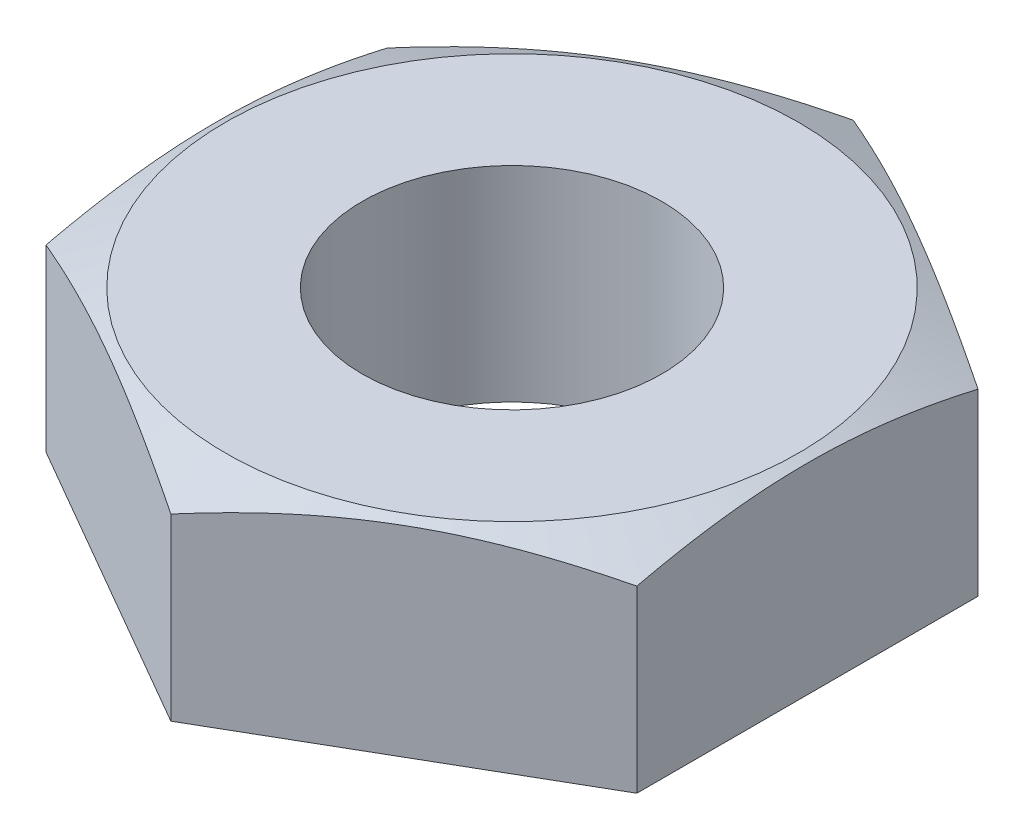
ISO-10303-21;
HEADER;
FILE_DESCRIPTION(('STEP AP214'),'2;1');
FILE_NAME('part.step','',(''),(''),'','','');
FILE_SCHEMA(('AUTOMOTIVE_DESIGN { 1 0 10303 214 1 1 1 1 }'));
ENDSEC;
DATA;
#1=APPLICATION_CONTEXT('core data for automotive mechanical design processes');
#2=APPLICATION_PROTOCOL_DEFINITION('international standard','automotive_design',2000,#1);
#3=PRODUCT_CONTEXT('',#1,'mechanical');
#4=PRODUCT('Part','Part','',(#3));
#5=PRODUCT_RELATED_PRODUCT_CATEGORY('part','',(#4));
#6=PRODUCT_DEFINITION_FORMATION('','',#4);
#7=PRODUCT_DEFINITION_CONTEXT('part definition',#1,'design');
#8=PRODUCT_DEFINITION('design','',#6,#7);
#9=PRODUCT_DEFINITION_SHAPE('','',#8);
#10=(LENGTH_UNIT() NAMED_UNIT(*) SI_UNIT(.MILLI.,.METRE.));
#11=(NAMED_UNIT(*) PLANE_ANGLE_UNIT() SI_UNIT($,.RADIAN.));
#12=(NAMED_UNIT(*) SI_UNIT($,.STERADIAN.) SOLID_ANGLE_UNIT());
#13=UNCERTAINTY_MEASURE_WITH_UNIT(LENGTH_MEASURE(1.E-05),#10,'distance_accuracy_value','');
#14=(GEOMETRIC_REPRESENTATION_CONTEXT(3) GLOBAL_UNCERTAINTY_ASSIGNED_CONTEXT((#13)) GLOBAL_UNIT_ASSIGNED_CONTEXT((#10,
#11,#12)) REPRESENTATION_CONTEXT('',''));
#15=CARTESIAN_POINT('',(0.,0.,0.));
#16=DIRECTION('',(0.,0.,1.));
#17=DIRECTION('',(1.,0.,0.));
#18=AXIS2_PLACEMENT_3D('',#15,#16,#17);
#19=CARTESIAN_POINT('',(-1.66533453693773E-13,-33.0200000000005,9.99200722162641E-13));
#20=DIRECTION('',(0.,-1.,0.));
#21=DIRECTION('',(0.,0.,-1.00000000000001));
#22=AXIS2_PLACEMENT_3D('',#19,#20,#21);
#23=CYLINDRICAL_SURFACE('',#22,2.413);
#24=CARTESIAN_POINT('',(-6.38378239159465E-13,-5.96744875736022E-13,1.11022302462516E-13));
#25=DIRECTION('',(0.,-1.,0.));
#26=DIRECTION('',(0.,0.,-1.00000000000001));
#27=AXIS2_PLACEMENT_3D('',#24,#25,#26);
#28=CIRCLE('',#27,2.413);
#29=CARTESIAN_POINT('',(-6.46147246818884E-13,-5.96744890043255E-13,-2.41299999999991));
#30=VERTEX_POINT('',#29);
#31=EDGE_CURVE('E11',#30,#30,#28,.T.);
#32=ORIENTED_EDGE('',*,*,#31,.T.);
#33=EDGE_LOOP('',(#32));
#34=FACE_BOUND('',#33,.T.);
#35=CARTESIAN_POINT('',(-1.11022302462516E-13,3.30199999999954,-4.44089209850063E-13));
#36=DIRECTION('',(0.,-1.,0.));
#37=DIRECTION('',(0.,0.,-1.00000000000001));
#38=AXIS2_PLACEMENT_3D('',#35,#36,#37);
#39=CIRCLE('',#38,2.413);
#40=CARTESIAN_POINT('',(-1.18791310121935E-13,3.30199999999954,-2.41300000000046));
#41=VERTEX_POINT('',#40);
#42=EDGE_CURVE('E38',#41,#41,#39,.T.);
#43=ORIENTED_EDGE('',*,*,#42,.F.);
#44=EDGE_LOOP('',(#43));
#45=FACE_BOUND('',#44,.T.);
#46=ADVANCED_FACE('F31',(#34,#45),#23,.F.);
#47=CARTESIAN_POINT('',(2.41299999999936,3.30199999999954,-6.66133814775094E-13));
#48=DIRECTION('',(0.,1.,0.));
#49=DIRECTION('',(0.,0.,1.00000000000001));
#50=AXIS2_PLACEMENT_3D('',#47,#48,#49);
#51=PLANE('',#50);
#52=ORIENTED_EDGE('',*,*,#42,.T.);
#53=EDGE_LOOP('',(#52));
#54=FACE_BOUND('',#53,.T.);
#55=CARTESIAN_POINT('',(-1.11022302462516E-13,3.30199999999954,-4.44089209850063E-13));
#56=DIRECTION('',(0.,-1.,0.));
#57=DIRECTION('',(0.,0.,-1.00000000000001));
#58=AXIS2_PLACEMENT_3D('',#55,#56,#57);
#59=CIRCLE('',#58,4.6193795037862);
#60=CARTESIAN_POINT('',(-1.25895072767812E-13,3.30199999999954,-4.61937950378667));
#61=VERTEX_POINT('',#60);
#62=EDGE_CURVE('E196',#61,#61,#59,.T.);
#63=ORIENTED_EDGE('',*,*,#62,.F.);
#64=EDGE_LOOP('',(#63));
#65=FACE_BOUND('',#64,.T.);
#66=ADVANCED_FACE('F184',(#54,#65),#51,.T.);
#67=CARTESIAN_POINT('',(-8.32667268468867E-13,2.89170437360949,-6.10622663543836E-13));
#68=DIRECTION('',(0.,-1.,0.));
#69=DIRECTION('',(0.,0.,-1.00000000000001));
#70=AXIS2_PLACEMENT_3D('',#67,#68,#69);
#71=CONICAL_SURFACE('',#70,5.49926131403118,1.1344640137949);
#72=CARTESIAN_POINT('',(4.76249999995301,1.39901202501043,-7.28111877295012));
#73=CARTESIAN_POINT('',(4.76249999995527,1.48248377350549,-7.06715898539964));
#74=CARTESIAN_POINT('',(4.76249999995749,1.56504133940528,-6.85283581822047));
#75=CARTESIAN_POINT('',(4.76249999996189,1.72780949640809,-6.42326997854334));
#76=CARTESIAN_POINT('',(4.76249999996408,1.80801978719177,-6.20802719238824));
#77=CARTESIAN_POINT('',(4.76249999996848,1.9658210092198,-5.77575029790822));
#78=CARTESIAN_POINT('',(4.7624999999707,2.04340210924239,-5.55871258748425));
#79=CARTESIAN_POINT('',(4.76249999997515,2.19491950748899,-5.12337226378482));
#80=CARTESIAN_POINT('',(4.76249999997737,2.26885593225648,-4.90506969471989));
#81=CARTESIAN_POINT('',(4.76249999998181,2.41118332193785,-4.46988361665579));
#82=CARTESIAN_POINT('',(4.76249999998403,2.47963519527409,-4.25302013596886));
#83=CARTESIAN_POINT('',(4.76249999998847,2.61090094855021,-3.81757071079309));
#84=CARTESIAN_POINT('',(4.7624999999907,2.67371453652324,-3.59898467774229));
#85=CARTESIAN_POINT('',(4.76249999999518,2.79215170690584,-3.16008124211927));
#86=CARTESIAN_POINT('',(4.76249999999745,2.84778233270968,-2.93976576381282));
#87=CARTESIAN_POINT('',(4.76250000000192,2.95011277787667,-2.49709707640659));
#88=CARTESIAN_POINT('',(4.76250000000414,2.99681384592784,-2.27474415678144));
#89=CARTESIAN_POINT('',(4.76250000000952,3.09428518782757,-1.74621511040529));
#90=CARTESIAN_POINT('',(4.76250000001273,3.14030092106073,-1.43911371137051));
#91=CARTESIAN_POINT('',(4.76250000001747,3.19014406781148,-0.976499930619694));
#92=CARTESIAN_POINT('',(4.76250000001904,3.20356111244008,-0.821992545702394));
#93=CARTESIAN_POINT('',(4.76250000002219,3.22358033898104,-0.512526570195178));
#94=CARTESIAN_POINT('',(4.76250000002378,3.23018257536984,-0.357567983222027));
#95=CARTESIAN_POINT('',(4.76250000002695,3.23633945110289,-0.0468466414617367));
#96=CARTESIAN_POINT('',(4.76250000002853,3.23586378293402,0.108916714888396));
#97=CARTESIAN_POINT('',(4.76250000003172,3.22781059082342,0.42025958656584));
#98=CARTESIAN_POINT('',(4.76250000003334,3.2202329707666,0.57583909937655));
#99=CARTESIAN_POINT('',(4.76250000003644,3.19824799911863,0.886538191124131));
#100=CARTESIAN_POINT('',(4.76250000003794,3.18383946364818,1.04165768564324));
#101=CARTESIAN_POINT('',(4.76250000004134,3.14867739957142,1.35115677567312));
#102=CARTESIAN_POINT('',(4.76250000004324,3.12792406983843,1.50553639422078));
#103=CARTESIAN_POINT('',(4.76250000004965,3.04027443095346,2.07678956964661));
#104=CARTESIAN_POINT('',(4.76250000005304,2.95517532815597,2.4909257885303));
#105=CARTESIAN_POINT('',(4.76250000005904,2.80579231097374,3.10669744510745));
#106=CARTESIAN_POINT('',(4.76250000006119,2.75233403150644,3.3111794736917));
#107=CARTESIAN_POINT('',(4.7625000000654,2.63953896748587,3.71852412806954));
#108=CARTESIAN_POINT('',(4.76250000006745,2.5802025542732,3.92138685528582));
#109=CARTESIAN_POINT('',(4.76250000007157,2.45646587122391,4.32677467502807));
#110=CARTESIAN_POINT('',(4.76250000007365,2.39203933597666,4.52929165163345));
#111=CARTESIAN_POINT('',(4.76250000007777,2.25934369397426,4.93306201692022));
#112=CARTESIAN_POINT('',(4.76250000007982,2.19107454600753,5.13431539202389));
#113=CARTESIAN_POINT('',(4.76250000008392,2.05146838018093,5.53563759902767));
#114=CARTESIAN_POINT('',(4.76250000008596,1.98013292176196,5.73570697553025));
#115=CARTESIAN_POINT('',(4.76250000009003,1.834934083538,6.13492790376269));
#116=CARTESIAN_POINT('',(4.76250000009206,1.76107065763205,6.33407943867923));
#117=CARTESIAN_POINT('',(4.76250000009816,1.53585582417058,6.93180306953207));
#118=CARTESIAN_POINT('',(4.76250000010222,1.38138978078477,7.32920086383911));
#119=CARTESIAN_POINT('',(4.76250000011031,1.06676810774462,8.12178148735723));
#120=CARTESIAN_POINT('',(4.76250000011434,0.906611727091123,8.51696401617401));
#121=CARTESIAN_POINT('',(4.76250000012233,0.584326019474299,9.30061588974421));
#122=CARTESIAN_POINT('',(4.7625000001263,0.422248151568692,9.68910643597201));
#123=CARTESIAN_POINT('',(4.76250000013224,0.176972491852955,10.2708789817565));
#124=CARTESIAN_POINT('',(4.76250000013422,0.0948632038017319,10.4646215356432));
#125=CARTESIAN_POINT('',(4.76250000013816,-0.0699891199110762,10.8518355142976));
#126=CARTESIAN_POINT('',(4.76250000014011,-0.152732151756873,11.0453069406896));
#127=CARTESIAN_POINT('',(4.76250000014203,-0.23574680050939,11.2386618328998));
#128=B_SPLINE_CURVE_WITH_KNOTS('',3,(#72,#73,#74,#75,#76,#77,#78,#79,#80,#81,#82,#83,#84,#85,
#86,#87,#88,#89,#90,#91,#92,#93,#94,#95,#96,#97,#98,#99,#100,#101,#102,#103,#104,#105,#106,#107,
#108,#109,#110,#111,#112,#113,#114,#115,#116,#117,#118,#119,#120,#121,#122,#123,#124,#125,#126,
#127),.UNSPECIFIED.,.F.,.F.,(4,2,2,2,2,2,2,2,2,2,2,2,2,2,2,2,2,2,2,2,2,2,2,2,2,2,2,4),(0.,
0.689004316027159,1.37809640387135,2.06953100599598,2.76094158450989,3.44311143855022,
4.12531659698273,4.80684764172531,5.48828331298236,6.41885233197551,6.88399234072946,
7.34912863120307,7.81625720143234,8.2833920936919,8.75060797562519,9.21780921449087,
10.4842421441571,11.1182778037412,11.7522734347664,12.3897861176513,13.02730563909,
13.6645046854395,14.3017153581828,15.580727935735,16.8599099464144,18.1227257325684,
18.7539959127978,19.3852622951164),.UNSPECIFIED.);
#129=CARTESIAN_POINT('',(4.76249999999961,2.8917043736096,-2.74963065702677));
#130=VERTEX_POINT('',#129);
#131=CARTESIAN_POINT('',(4.76250000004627,2.89170437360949,2.74963065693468));
#132=VERTEX_POINT('',#131);
#133=EDGE_CURVE('E170',#130,#132,#128,.T.);
#134=ORIENTED_EDGE('',*,*,#133,.F.);
#135=CARTESIAN_POINT('',(-0.000200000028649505,2.89165052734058,-5.4993767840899));
#136=CARTESIAN_POINT('',(0.143828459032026,2.93042689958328,-5.41622191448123));
#137=CARTESIAN_POINT('',(0.288388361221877,2.96671319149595,-5.33276021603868));
#138=CARTESIAN_POINT('',(0.578592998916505,3.03344126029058,-5.16521049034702));
#139=CARTESIAN_POINT('',(0.724238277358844,3.06387987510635,-5.08112214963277));
#140=CARTESIAN_POINT('',(1.0166170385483,3.11802986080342,-4.91231719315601));
#141=CARTESIAN_POINT('',(1.16335141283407,3.14173490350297,-4.82760006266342));
#142=CARTESIAN_POINT('',(1.4575724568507,3.18154271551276,-4.65773146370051));
#143=CARTESIAN_POINT('',(1.60505898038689,3.19764690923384,-4.57258007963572));
#144=CARTESIAN_POINT('',(1.89747592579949,3.22136340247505,-4.40375307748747));
#145=CARTESIAN_POINT('',(2.04239593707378,3.22914485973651,-4.32008346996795));
#146=CARTESIAN_POINT('',(2.33240313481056,3.2364756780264,-4.15264773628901));
#147=CARTESIAN_POINT('',(2.47749033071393,3.23602454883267,-4.0688816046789));
#148=CARTESIAN_POINT('',(2.76733261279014,3.22691293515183,-3.90154108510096));
#149=CARTESIAN_POINT('',(2.91208788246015,3.21826010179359,-3.817966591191));
#150=CARTESIAN_POINT('',(3.20106949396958,3.19311762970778,-3.65112297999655));
#151=CARTESIAN_POINT('',(3.34529588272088,3.17662870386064,-3.56785383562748));
#152=CARTESIAN_POINT('',(3.59582570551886,3.14163618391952,-3.42321037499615));
#153=CARTESIAN_POINT('',(3.70230276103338,3.12475288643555,-3.36173581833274));
#154=CARTESIAN_POINT('',(3.9147700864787,3.08733994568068,-3.2390677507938));
#155=CARTESIAN_POINT('',(4.02076037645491,3.06681045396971,-3.17787422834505));
#156=CARTESIAN_POINT('',(4.23307314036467,3.02226176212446,-3.05529539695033));
#157=CARTESIAN_POINT('',(4.3393913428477,2.9982156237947,-2.99391255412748));
#158=CARTESIAN_POINT('',(4.55146553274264,2.94710845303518,-2.87147146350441));
#159=CARTESIAN_POINT('',(4.65722161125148,2.92004792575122,-2.81041316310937));
#160=CARTESIAN_POINT('',(4.7626999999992,2.89165052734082,-2.74951518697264));
#161=B_SPLINE_CURVE_WITH_KNOTS('',3,(#135,#136,#137,#138,#139,#140,#141,#142,#143,#144,#145,
#146,#147,#148,#149,#150,#151,#152,#153,#154,#155,#156,#157,#158,#159,#160),.UNSPECIFIED.,.F.,
.F.,(4,2,2,2,2,2,2,2,2,2,2,2,4),(0.,0.512340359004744,1.02495698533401,1.53805378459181,
2.05105439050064,2.55341778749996,3.05581109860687,3.55773620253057,4.05961565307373,
4.43186988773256,4.80410865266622,5.1793647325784,5.55455802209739),.UNSPECIFIED.);
#162=CARTESIAN_POINT('',(-2.89213097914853E-11,2.89170437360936,-5.49926131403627));
#163=VERTEX_POINT('',#162);
#164=EDGE_CURVE('E92',#163,#130,#161,.T.);
#165=ORIENTED_EDGE('',*,*,#164,.F.);
#166=CARTESIAN_POINT('',(-4.76270000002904,2.89165052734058,-2.74951518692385));
#167=CARTESIAN_POINT('',(-4.61867154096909,2.93042689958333,-2.83267005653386));
#168=CARTESIAN_POINT('',(-4.47411163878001,2.96671319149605,-2.91613175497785));
#169=CARTESIAN_POINT('',(-4.18390700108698,3.03344126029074,-3.08368148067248));
#170=CARTESIAN_POINT('',(-4.03826172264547,3.06387987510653,-3.16776982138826));
#171=CARTESIAN_POINT('',(-3.7458829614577,3.11802986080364,-3.33657477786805));
#172=CARTESIAN_POINT('',(-3.59914858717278,3.14173490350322,-3.42129190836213));
#173=CARTESIAN_POINT('',(-3.30492754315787,3.18154271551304,-3.59116050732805));
#174=CARTESIAN_POINT('',(-3.15744101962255,3.19764690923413,-3.67631189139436));
#175=CARTESIAN_POINT('',(-2.86502407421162,3.22136340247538,-3.84513889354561));
#176=CARTESIAN_POINT('',(-2.72010406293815,3.22914485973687,-3.9288085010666));
#177=CARTESIAN_POINT('',(-2.43009686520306,3.23647567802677,-4.09624423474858));
#178=CARTESIAN_POINT('',(-2.28500966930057,3.23602454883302,-4.18001036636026));
#179=CARTESIAN_POINT('',(-1.9951673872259,3.22691293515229,-4.34735088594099));
#180=CARTESIAN_POINT('',(-1.85041211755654,3.21826010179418,-4.43092537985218));
#181=CARTESIAN_POINT('',(-1.5614305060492,3.19311762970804,-4.59776899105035));
#182=CARTESIAN_POINT('',(-1.41720411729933,3.17662870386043,-4.68103813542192));
#183=CARTESIAN_POINT('',(-1.16667429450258,3.14163618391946,-4.82568159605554));
#184=CARTESIAN_POINT('',(-1.06019723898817,3.12475288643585,-4.88715615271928));
#185=CARTESIAN_POINT('',(-0.847729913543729,3.08733994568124,-5.00982422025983));
#186=CARTESIAN_POINT('',(-0.741739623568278,3.06681045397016,-5.07101774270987));
#187=CARTESIAN_POINT('',(-0.529426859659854,3.02226176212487,-5.19359657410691));
#188=CARTESIAN_POINT('',(-0.42310865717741,2.99821562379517,-5.25497941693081));
#189=CARTESIAN_POINT('',(-0.211034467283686,2.94710845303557,-5.37742050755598));
#190=CARTESIAN_POINT('',(-0.105278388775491,2.92004792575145,-5.43847880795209));
#191=CARTESIAN_POINT('',(0.000199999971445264,2.89165052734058,-5.49937678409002));
#192=B_SPLINE_CURVE_WITH_KNOTS('',3,(#166,#167,#168,#169,#170,#171,#172,#173,#174,#175,#176,
#177,#178,#179,#180,#181,#182,#183,#184,#185,#186,#187,#188,#189,#190,#191),.UNSPECIFIED.,.F.,
.F.,(4,2,2,2,2,2,2,2,2,2,2,2,4),(0.,0.512340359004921,1.02495698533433,1.53805378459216,
2.05105439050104,2.55341778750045,3.05581109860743,3.55773620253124,4.05961565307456,
4.43186988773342,4.8041086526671,5.17936473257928,5.55455802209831),.UNSPECIFIED.);
#193=CARTESIAN_POINT('',(-4.76250000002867,2.89170437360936,-2.74963065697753));
#194=VERTEX_POINT('',#193);
#195=EDGE_CURVE('E161',#194,#163,#192,.T.);
#196=ORIENTED_EDGE('',*,*,#195,.F.);
#197=CARTESIAN_POINT('',(-4.76250000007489,1.39901202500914,-7.28111877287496));
#198=CARTESIAN_POINT('',(-4.7625000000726,1.4824837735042,-7.06715898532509));
#199=CARTESIAN_POINT('',(-4.76250000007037,1.56504133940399,-6.85283581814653));
#200=CARTESIAN_POINT('',(-4.76250000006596,1.72780949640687,-6.42326997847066));
#201=CARTESIAN_POINT('',(-4.76250000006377,1.80801978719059,-6.20802719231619));
#202=CARTESIAN_POINT('',(-4.76250000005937,1.96582100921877,-5.77575029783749));
#203=CARTESIAN_POINT('',(-4.76250000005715,2.04340210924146,-5.55871258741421));
#204=CARTESIAN_POINT('',(-4.7625000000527,2.19491950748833,-5.12337226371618));
#205=CARTESIAN_POINT('',(-4.76250000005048,2.26885593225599,-4.90506969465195));
#206=CARTESIAN_POINT('',(-4.76250000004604,2.41118332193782,-4.46988361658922));
#207=CARTESIAN_POINT('',(-4.76250000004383,2.47963519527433,-4.25302013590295));
#208=CARTESIAN_POINT('',(-4.76250000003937,2.61090094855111,-3.81757071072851));
#209=CARTESIAN_POINT('',(-4.76250000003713,2.6737145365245,-3.59898467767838));
#210=CARTESIAN_POINT('',(-4.76250000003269,2.79215170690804,-3.16008124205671));
#211=CARTESIAN_POINT('',(-4.7625000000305,2.84778233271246,-2.93976576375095));
#212=CARTESIAN_POINT('',(-4.76250000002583,2.95011277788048,-2.49709707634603));
#213=CARTESIAN_POINT('',(-4.76250000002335,2.99681384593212,-2.2747441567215));
#214=CARTESIAN_POINT('',(-4.76250000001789,3.09428518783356,-1.74621511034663));
#215=CARTESIAN_POINT('',(-4.76250000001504,3.14030092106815,-1.43911371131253));
#216=CARTESIAN_POINT('',(-4.76250000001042,3.19014406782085,-0.976499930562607));
#217=CARTESIAN_POINT('',(-4.76250000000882,3.20356111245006,-0.821992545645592));
#218=CARTESIAN_POINT('',(-4.76250000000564,3.22358033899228,-0.512526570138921));
#219=CARTESIAN_POINT('',(-4.76250000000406,3.23018257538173,-0.357567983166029));
#220=CARTESIAN_POINT('',(-4.7625000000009,3.23633945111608,-0.0468466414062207));
#221=CARTESIAN_POINT('',(-4.76249999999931,3.23586378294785,0.108916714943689));
#222=CARTESIAN_POINT('',(-4.76249999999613,3.22781059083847,0.420259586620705));
#223=CARTESIAN_POINT('',(-4.76249999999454,3.22023297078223,0.575839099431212));
#224=CARTESIAN_POINT('',(-4.76249999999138,3.19824799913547,0.886538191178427));
#225=CARTESIAN_POINT('',(-4.76249999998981,3.18383946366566,1.04165768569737));
#226=CARTESIAN_POINT('',(-4.76249999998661,3.1486773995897,1.35115677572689));
#227=CARTESIAN_POINT('',(-4.76249999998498,3.12792406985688,1.50553639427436));
#228=CARTESIAN_POINT('',(-4.76249999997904,3.0402744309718,2.07678956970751));
#229=CARTESIAN_POINT('',(-4.76249999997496,2.95517532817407,2.49092578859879));
#230=CARTESIAN_POINT('',(-4.76249999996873,2.80579231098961,3.1066974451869));
#231=CARTESIAN_POINT('',(-4.76249999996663,2.75233403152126,3.31117947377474));
#232=CARTESIAN_POINT('',(-4.76249999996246,2.63953896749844,3.71852412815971));
#233=CARTESIAN_POINT('',(-4.7624999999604,2.58020255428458,3.92138685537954));
#234=CARTESIAN_POINT('',(-4.76249999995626,2.4564658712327,4.32677467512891));
#235=CARTESIAN_POINT('',(-4.7624999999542,2.39203933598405,4.52929165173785));
#236=CARTESIAN_POINT('',(-4.76249999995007,2.25934369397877,4.93306201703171));
#237=CARTESIAN_POINT('',(-4.76249999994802,2.19107454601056,5.1343153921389));
#238=CARTESIAN_POINT('',(-4.76249999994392,2.05146838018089,5.53563759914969));
#239=CARTESIAN_POINT('',(-4.76249999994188,1.98013292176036,5.73570697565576));
#240=CARTESIAN_POINT('',(-4.76249999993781,1.83493408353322,6.13492790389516));
#241=CARTESIAN_POINT('',(-4.76249999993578,1.76107065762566,6.33407943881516));
#242=CARTESIAN_POINT('',(-4.76249999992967,1.53585582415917,6.93180306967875));
#243=CARTESIAN_POINT('',(-4.76249999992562,1.38138978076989,7.32920086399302));
#244=CARTESIAN_POINT('',(-4.76249999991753,1.06676810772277,8.12178148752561));
#245=CARTESIAN_POINT('',(-4.7624999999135,0.906611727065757,8.51696401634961));
#246=CARTESIAN_POINT('',(-4.76249999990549,0.584326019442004,9.3006158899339));
#247=CARTESIAN_POINT('',(-4.76249999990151,0.422248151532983,9.68910643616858));
#248=CARTESIAN_POINT('',(-4.76249999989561,0.176972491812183,10.2708789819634));
#249=CARTESIAN_POINT('',(-4.76249999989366,0.094863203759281,10.4646215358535));
#250=CARTESIAN_POINT('',(-4.76249999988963,-0.0699891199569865,10.8518355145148));
#251=CARTESIAN_POINT('',(-4.76249999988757,-0.152732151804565,11.0453069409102));
#252=CARTESIAN_POINT('',(-4.76249999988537,-0.235746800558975,11.2386618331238));
#253=B_SPLINE_CURVE_WITH_KNOTS('',3,(#197,#198,#199,#200,#201,#202,#203,#204,#205,#206,#207,
#208,#209,#210,#211,#212,#213,#214,#215,#216,#217,#218,#219,#220,#221,#222,#223,#224,#225,#226,
#227,#228,#229,#230,#231,#232,#233,#234,#235,#236,#237,#238,#239,#240,#241,#242,#243,#244,#245,
#246,#247,#248,#249,#250,#251,#252),.UNSPECIFIED.,.F.,.F.,(4,2,2,2,2,2,2,2,2,2,2,2,2,2,2,2,2,2,
2,2,2,2,2,2,2,2,2,4),(0.,0.689004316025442,1.37809640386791,2.06953100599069,2.76094158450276,
3.44311143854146,4.12531659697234,4.80684764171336,5.48828331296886,6.41885233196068,
6.88399234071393,7.34912863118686,7.81625720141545,8.28339209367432,8.75060797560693,
9.21780921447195,10.4842421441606,11.1182778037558,11.7522734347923,12.3897861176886,
13.0273056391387,13.6645046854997,14.3017153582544,15.5807279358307,16.8599099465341,
18.122725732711,18.753995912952,19.3852622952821),.UNSPECIFIED.);
#254=CARTESIAN_POINT('',(-4.76249999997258,2.89170437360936,2.74963065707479));
#255=VERTEX_POINT('',#254);
#256=EDGE_CURVE('E156',#255,#194,#253,.F.);
#257=ORIENTED_EDGE('',*,*,#256,.F.);
#258=CARTESIAN_POINT('',(0.0002000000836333,2.8916505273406,5.49937678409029));
#259=CARTESIAN_POINT('',(-0.143828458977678,2.93042689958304,5.4162219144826));
#260=CARTESIAN_POINT('',(-0.288388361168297,2.96671319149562,5.33276021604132));
#261=CARTESIAN_POINT('',(-0.57859299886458,3.0334412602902,5.16521049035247));
#262=CARTESIAN_POINT('',(-0.724238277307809,3.06387987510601,5.08112214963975));
#263=CARTESIAN_POINT('',(-1.01661703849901,3.11802986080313,4.91231719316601));
#264=CARTESIAN_POINT('',(-1.16335141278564,3.14173490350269,4.8276000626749));
#265=CARTESIAN_POINT('',(-1.45757245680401,3.18154271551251,4.65773146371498));
#266=CARTESIAN_POINT('',(-1.60505898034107,3.1976469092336,4.5725800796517));
#267=CARTESIAN_POINT('',(-1.89747592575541,3.22136340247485,4.40375307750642));
#268=CARTESIAN_POINT('',(-2.04239593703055,3.22914485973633,4.32008346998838));
#269=CARTESIAN_POINT('',(-2.33240313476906,3.23647567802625,4.15264773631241));
#270=CARTESIAN_POINT('',(-2.47749033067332,3.23602454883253,4.0688816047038));
#271=CARTESIAN_POINT('',(-2.76733261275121,3.22691293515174,3.90154108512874));
#272=CARTESIAN_POINT('',(-2.91208788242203,3.21826010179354,3.81796659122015));
#273=CARTESIAN_POINT('',(-3.20106949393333,3.1931176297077,3.65112298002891));
#274=CARTESIAN_POINT('',(-3.3452958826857,3.17662870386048,3.56785383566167));
#275=CARTESIAN_POINT('',(-3.59582570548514,3.14163618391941,3.42321037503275));
#276=CARTESIAN_POINT('',(-3.70230276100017,3.12475288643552,3.36173581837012));
#277=CARTESIAN_POINT('',(-3.91477008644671,3.08733994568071,3.2390677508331));
#278=CARTESIAN_POINT('',(-4.02076037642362,3.06681045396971,3.17787422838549));
#279=CARTESIAN_POINT('',(-4.23307314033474,3.02226176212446,3.05529539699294));
#280=CARTESIAN_POINT('',(-4.33939134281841,2.99821562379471,2.99391255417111));
#281=CARTESIAN_POINT('',(-4.55146553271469,2.94710845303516,2.8714714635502));
#282=CARTESIAN_POINT('',(-4.65722161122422,2.92004792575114,2.81041316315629));
#283=CARTESIAN_POINT('',(-4.76269999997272,2.89165052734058,2.74951518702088));
#284=B_SPLINE_CURVE_WITH_KNOTS('',3,(#258,#259,#260,#261,#262,#263,#264,#265,#266,#267,#268,
#269,#270,#271,#272,#273,#274,#275,#276,#277,#278,#279,#280,#281,#282,#283),.UNSPECIFIED.,.F.,
.F.,(4,2,2,2,2,2,2,2,2,2,2,2,4),(0.,0.512340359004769,1.02495698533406,1.53805378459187,
2.05105439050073,2.55341778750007,3.05581109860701,3.55773620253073,4.05961565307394,
4.4318698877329,4.80410865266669,5.17936473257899,5.55455802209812),.UNSPECIFIED.);
#285=CARTESIAN_POINT('',(8.3322237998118E-11,2.89170437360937,5.499261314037));
#286=VERTEX_POINT('',#285);
#287=EDGE_CURVE('E132',#286,#255,#284,.T.);
#288=ORIENTED_EDGE('',*,*,#287,.F.);
#289=CARTESIAN_POINT('',(4.76270000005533,2.89165052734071,2.74951518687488));
#290=CARTESIAN_POINT('',(4.61867154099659,2.93042689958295,2.83267005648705));
#291=CARTESIAN_POINT('',(4.47411163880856,2.96671319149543,2.91613175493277));
#292=CARTESIAN_POINT('',(4.18390700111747,3.03344126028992,3.0836814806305));
#293=CARTESIAN_POINT('',(4.03826172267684,3.06387987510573,3.16776982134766));
#294=CARTESIAN_POINT('',(3.74588296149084,3.11802986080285,3.33657477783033));
#295=CARTESIAN_POINT('',(3.5991485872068,3.14173490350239,3.42129190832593));
#296=CARTESIAN_POINT('',(3.30492754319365,3.18154271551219,3.59116050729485));
#297=CARTESIAN_POINT('',(3.15744101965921,3.19764690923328,3.67631189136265));
#298=CARTESIAN_POINT('',(2.86502407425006,3.2213634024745,3.84513889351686));
#299=CARTESIAN_POINT('',(2.72010406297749,3.22914485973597,3.92880850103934));
#300=CARTESIAN_POINT('',(2.43009686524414,3.2364756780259,4.09624423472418));
#301=CARTESIAN_POINT('',(2.28500966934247,3.23602454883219,4.18001036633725));
#302=CARTESIAN_POINT('',(1.99516738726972,3.22691293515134,4.34735088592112));
#303=CARTESIAN_POINT('',(1.85041211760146,3.21826010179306,4.43092537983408));
#304=CARTESIAN_POINT('',(1.56143050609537,3.19311762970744,4.59776899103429));
#305=CARTESIAN_POINT('',(1.41720411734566,3.17662870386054,4.68103813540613));
#306=CARTESIAN_POINT('',(1.16667429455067,3.14163618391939,4.82568159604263));
#307=CARTESIAN_POINT('',(1.06019723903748,3.12475288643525,4.88715615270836));
#308=CARTESIAN_POINT('',(0.84772991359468,3.08733994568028,5.00982422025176));
#309=CARTESIAN_POINT('',(0.741739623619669,3.06681045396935,5.07101774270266));
#310=CARTESIAN_POINT('',(0.529426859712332,3.02226176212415,5.19359657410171));
#311=CARTESIAN_POINT('',(0.423108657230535,2.99821562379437,5.25497941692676));
#312=CARTESIAN_POINT('',(0.211034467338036,2.94710845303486,5.3774205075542));
#313=CARTESIAN_POINT('',(0.105278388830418,2.92004792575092,5.43847880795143));
#314=CARTESIAN_POINT('',(-0.000199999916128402,2.8916505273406,5.49937678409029));
#315=B_SPLINE_CURVE_WITH_KNOTS('',3,(#289,#290,#291,#292,#293,#294,#295,#296,#297,#298,#299,
#300,#301,#302,#303,#304,#305,#306,#307,#308,#309,#310,#311,#312,#313,#314),.UNSPECIFIED.,.F.,
.F.,(4,2,2,2,2,2,2,2,2,2,2,2,4),(0.,0.512340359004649,1.02495698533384,1.53805378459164,
2.05105439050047,2.55341778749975,3.05581109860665,3.55773620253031,4.05961565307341,
4.43186988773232,4.80410865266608,5.17936473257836,5.55455802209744),.UNSPECIFIED.);
#316=EDGE_CURVE('E95',#132,#286,#315,.T.);
#317=ORIENTED_EDGE('',*,*,#316,.F.);
#318=EDGE_LOOP('',(#134,#165,#196,#257,#288,#317));
#319=FACE_BOUND('',#318,.T.);
#320=ORIENTED_EDGE('',*,*,#62,.T.);
#321=EDGE_LOOP('',(#320));
#322=FACE_BOUND('',#321,.T.);
#323=ADVANCED_FACE('F138',(#319,#322),#71,.T.);
#324=CARTESIAN_POINT('',(5.49926131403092,-3.7470027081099E-13,2.22044604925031E-13));
#325=DIRECTION('',(0.,-1.,0.));
#326=DIRECTION('',(0.,0.,-1.00000000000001));
#327=AXIS2_PLACEMENT_3D('',#324,#325,#326);
#328=PLANE('',#327);
#329=DIRECTION('',(-1.02114983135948E-11,0.,-1.00000000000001));
#330=VECTOR('',#329,1.);
#331=CARTESIAN_POINT('',(4.76250000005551,-4.85722573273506E-13,2.74963065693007));
#332=LINE('',#331,#330);
#333=CARTESIAN_POINT('',(4.76250000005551,-4.85722573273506E-13,2.74963065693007));
#334=VERTEX_POINT('',#333);
#335=CARTESIAN_POINT('',(4.7624999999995,-3.7470027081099E-13,-2.74963065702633));
#336=VERTEX_POINT('',#335);
#337=EDGE_CURVE('E99',#334,#336,#332,.T.);
#338=ORIENTED_EDGE('',*,*,#337,.F.);
#339=DIRECTION('',(0.866025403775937,0.,-0.500000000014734));
#340=VECTOR('',#339,1.);
#341=CARTESIAN_POINT('',(8.37108160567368E-11,-5.96744875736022E-13,5.49926131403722));
#342=LINE('',#341,#340);
#343=CARTESIAN_POINT('',(9.28701560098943E-11,-5.96744875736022E-13,5.49926131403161));
#344=VERTEX_POINT('',#343);
#345=EDGE_CURVE('E116',#344,#334,#342,.T.);
#346=ORIENTED_EDGE('',*,*,#345,.F.);
#347=DIRECTION('',(0.86602540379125,0.,0.499999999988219));
#348=VECTOR('',#347,1.);
#349=CARTESIAN_POINT('',(-4.76249999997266,-6.10622663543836E-13,2.7496306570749));
#350=LINE('',#349,#348);
#351=CARTESIAN_POINT('',(-4.76249999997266,-6.10622663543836E-13,2.7496306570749));
#352=VERTEX_POINT('',#351);
#353=EDGE_CURVE('E53',#352,#344,#350,.T.);
#354=ORIENTED_EDGE('',*,*,#353,.F.);
#355=DIRECTION('',(1.02114983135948E-11,0.,1.00000000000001));
#356=VECTOR('',#355,1.);
#357=CARTESIAN_POINT('',(-4.76250000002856,-6.10622663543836E-13,-2.74963065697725));
#358=LINE('',#357,#356);
#359=CARTESIAN_POINT('',(-4.76250000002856,-6.10622663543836E-13,-2.74963065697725));
#360=VERTEX_POINT('',#359);
#361=EDGE_CURVE('E110',#360,#352,#358,.T.);
#362=ORIENTED_EDGE('',*,*,#361,.F.);
#363=DIRECTION('',(-0.866025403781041,0.,0.500000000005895));
#364=VECTOR('',#363,1.);
#365=CARTESIAN_POINT('',(-2.85327317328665E-11,-6.10622663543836E-13,-5.49926131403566));
#366=LINE('',#365,#364);
#367=CARTESIAN_POINT('',(-2.85327317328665E-11,-6.10622663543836E-13,-5.49926131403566));
#368=VERTEX_POINT('',#367);
#369=EDGE_CURVE('E108',#368,#360,#366,.T.);
#370=ORIENTED_EDGE('',*,*,#369,.F.);
#371=DIRECTION('',(-0.866025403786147,0.,-0.499999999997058));
#372=VECTOR('',#371,1.);
#373=CARTESIAN_POINT('',(4.7624999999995,-3.7470027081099E-13,-2.74963065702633));
#374=LINE('',#373,#372);
#375=EDGE_CURVE('E89',#336,#368,#374,.T.);
#376=ORIENTED_EDGE('',*,*,#375,.F.);
#377=EDGE_LOOP('',(#338,#346,#354,#362,#370,#376));
#378=FACE_BOUND('',#377,.T.);
#379=ORIENTED_EDGE('',*,*,#31,.F.);
#380=EDGE_LOOP('',(#379));
#381=FACE_BOUND('',#380,.T.);
#382=ADVANCED_FACE('F104',(#378,#381),#328,.T.);
#383=CARTESIAN_POINT('',(4.76250000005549,3.30199999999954,2.7496306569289));
#384=DIRECTION('',(-1.,0.,1.02046704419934E-11));
#385=DIRECTION('',(1.02114983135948E-11,0.,1.00000000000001));
#386=AXIS2_PLACEMENT_3D('',#383,#384,#385);
#387=PLANE('',#386);
#388=ORIENTED_EDGE('',*,*,#133,.T.);
#389=DIRECTION('',(0.,-1.,0.));
#390=VECTOR('',#389,1.);
#391=CARTESIAN_POINT('',(4.76250000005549,3.30199999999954,2.7496306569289));
#392=LINE('',#391,#390);
#393=EDGE_CURVE('E45',#132,#334,#392,.T.);
#394=ORIENTED_EDGE('',*,*,#393,.T.);
#395=ORIENTED_EDGE('',*,*,#337,.T.);
#396=DIRECTION('',(0.,-1.,0.));
#397=VECTOR('',#396,1.);
#398=CARTESIAN_POINT('',(4.76249999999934,3.30199999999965,-2.74963065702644));
#399=LINE('',#398,#397);
#400=EDGE_CURVE('E84',#130,#336,#399,.T.);
#401=ORIENTED_EDGE('',*,*,#400,.F.);
#402=EDGE_LOOP('',(#388,#394,#395,#401));
#403=FACE_BOUND('',#402,.T.);
#404=ADVANCED_FACE('F100',(#403),#387,.F.);
#405=CARTESIAN_POINT('',(4.76249999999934,3.30199999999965,-2.74963065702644));
#406=DIRECTION('',(-0.499999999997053,0.,0.866025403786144));
#407=DIRECTION('',(0.866025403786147,0.,0.499999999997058));
#408=AXIS2_PLACEMENT_3D('',#405,#406,#407);
#409=PLANE('',#408);
#410=ORIENTED_EDGE('',*,*,#164,.T.);
#411=ORIENTED_EDGE('',*,*,#400,.T.);
#412=ORIENTED_EDGE('',*,*,#375,.T.);
#413=DIRECTION('',(0.,-1.,0.));
#414=VECTOR('',#413,1.);
#415=CARTESIAN_POINT('',(-2.85049761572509E-11,3.30199999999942,-5.499261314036));
#416=LINE('',#415,#414);
#417=EDGE_CURVE('E96',#163,#368,#416,.T.);
#418=ORIENTED_EDGE('',*,*,#417,.F.);
#419=EDGE_LOOP('',(#410,#411,#412,#418));
#420=FACE_BOUND('',#419,.T.);
#421=ADVANCED_FACE('F86',(#420),#409,.F.);
#422=CARTESIAN_POINT('',(-2.85049761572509E-11,3.30199999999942,-5.499261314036));
#423=DIRECTION('',(0.500000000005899,0.,0.866025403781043));
#424=DIRECTION('',(0.866025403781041,0.,-0.500000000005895));
#425=AXIS2_PLACEMENT_3D('',#422,#423,#424);
#426=PLANE('',#425);
#427=ORIENTED_EDGE('',*,*,#195,.T.);
#428=ORIENTED_EDGE('',*,*,#417,.T.);
#429=ORIENTED_EDGE('',*,*,#369,.T.);
#430=DIRECTION('',(0.,-1.,0.));
#431=VECTOR('',#430,1.);
#432=CARTESIAN_POINT('',(-4.76250000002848,3.30199999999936,-2.74963065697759));
#433=LINE('',#432,#431);
#434=EDGE_CURVE('E123',#194,#360,#433,.T.);
#435=ORIENTED_EDGE('',*,*,#434,.F.);
#436=EDGE_LOOP('',(#427,#428,#429,#435));
#437=FACE_BOUND('',#436,.T.);
#438=ADVANCED_FACE('F152',(#437),#426,.F.);
#439=CARTESIAN_POINT('',(-4.76250000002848,3.30199999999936,-2.74963065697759));
#440=DIRECTION('',(1.00000000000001,0.,-1.02055586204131E-11));
#441=DIRECTION('',(-1.02114983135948E-11,0.,-1.00000000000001));
#442=AXIS2_PLACEMENT_3D('',#439,#440,#441);
#443=PLANE('',#442);
#444=ORIENTED_EDGE('',*,*,#256,.T.);
#445=ORIENTED_EDGE('',*,*,#434,.T.);
#446=ORIENTED_EDGE('',*,*,#361,.T.);
#447=DIRECTION('',(0.,-1.,0.));
#448=VECTOR('',#447,1.);
#449=CARTESIAN_POINT('',(-4.76249999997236,3.30199999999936,2.74963065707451));
#450=LINE('',#449,#448);
#451=EDGE_CURVE('E121',#255,#352,#450,.T.);
#452=ORIENTED_EDGE('',*,*,#451,.F.);
#453=EDGE_LOOP('',(#444,#445,#446,#452));
#454=FACE_BOUND('',#453,.T.);
#455=ADVANCED_FACE('F148',(#454),#443,.F.);
#456=CARTESIAN_POINT('',(-4.76249999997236,3.30199999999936,2.74963065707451));
#457=DIRECTION('',(0.499999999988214,0.,-0.866025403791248));
#458=DIRECTION('',(-0.86602540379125,0.,-0.499999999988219));
#459=AXIS2_PLACEMENT_3D('',#456,#457,#458);
#460=PLANE('',#459);
#461=ORIENTED_EDGE('',*,*,#287,.T.);
#462=ORIENTED_EDGE('',*,*,#451,.T.);
#463=ORIENTED_EDGE('',*,*,#353,.T.);
#464=DIRECTION('',(0.,-1.,0.));
#465=VECTOR('',#464,1.);
#466=CARTESIAN_POINT('',(8.37108160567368E-11,3.30199999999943,5.49926131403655));
#467=LINE('',#466,#465);
#468=EDGE_CURVE('E119',#286,#344,#467,.T.);
#469=ORIENTED_EDGE('',*,*,#468,.F.);
#470=EDGE_LOOP('',(#461,#462,#463,#469));
#471=FACE_BOUND('',#470,.T.);
#472=ADVANCED_FACE('F144',(#471),#460,.F.);
#473=CARTESIAN_POINT('',(8.37108160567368E-11,3.30199999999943,5.49926131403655));
#474=DIRECTION('',(-0.500000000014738,0.,-0.86602540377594));
#475=DIRECTION('',(-0.866025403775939,0.,0.500000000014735));
#476=AXIS2_PLACEMENT_3D('',#473,#474,#475);
#477=PLANE('',#476);
#478=ORIENTED_EDGE('',*,*,#316,.T.);
#479=ORIENTED_EDGE('',*,*,#468,.T.);
#480=ORIENTED_EDGE('',*,*,#345,.T.);
#481=ORIENTED_EDGE('',*,*,#393,.F.);
#482=EDGE_LOOP('',(#478,#479,#480,#481));
#483=FACE_BOUND('',#482,.T.);
#484=ADVANCED_FACE('F141',(#483),#477,.F.);
#485=CLOSED_SHELL('',(#46,#66,#323,#382,#404,#421,#438,#455,#472,#484));
#486=MANIFOLD_SOLID_BREP('B2',#485);
#487=ADVANCED_BREP_SHAPE_REPRESENTATION('',(#18,#486),#14);
#488=SHAPE_DEFINITION_REPRESENTATION(#9,#487);
ENDSEC;
END-ISO-10303-21;
